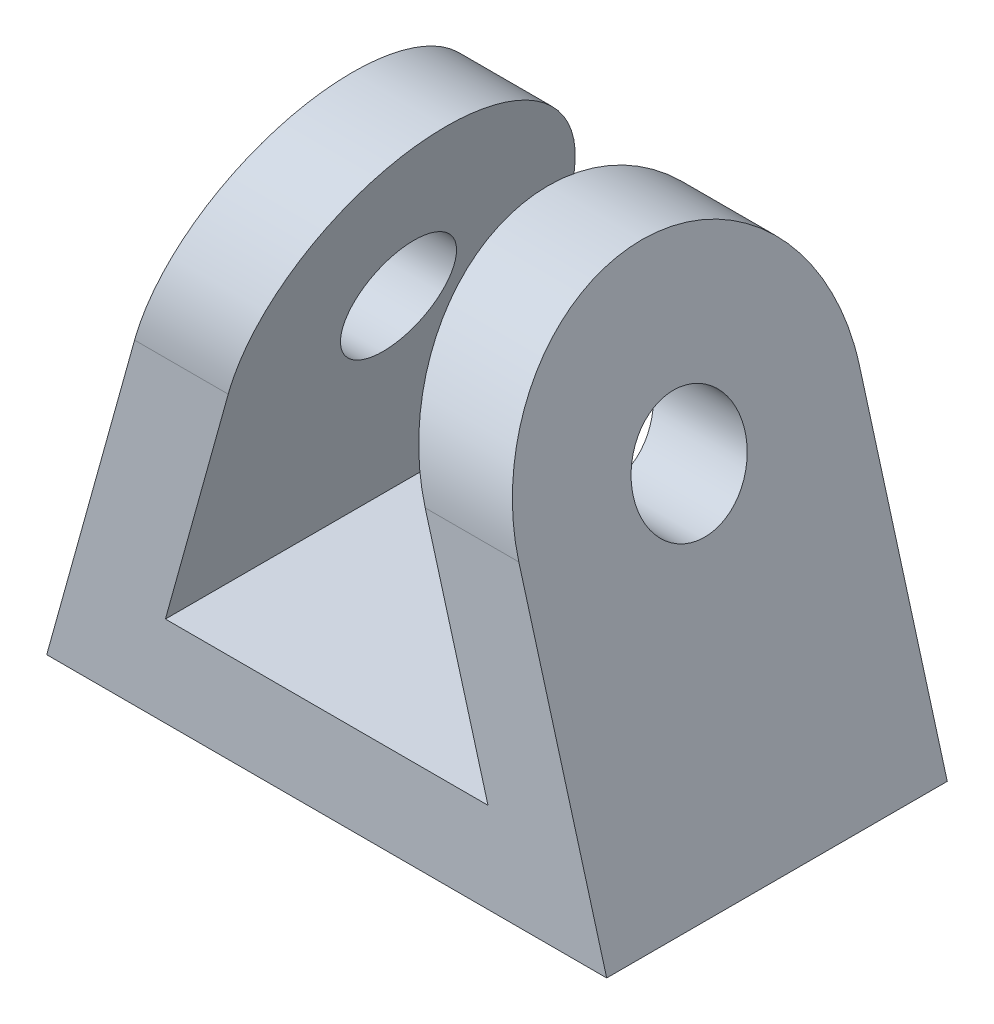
from build123d import *

# Parameters (mm, degrees)
EXTRUDE1_DEPTH = 45.974
SKETCH3_R      = 7.875092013
EXTRUDE2_DEPTH = 56.642


with BuildPart() as part:
    # Sketch1 → Extrude1 (new, symmetric)
    with BuildSketch(Plane.XY):
        Polygon((-39.410519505, 0), (-15.509946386, 86.06748937), (15.509946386, 86.06748937), (39.410519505, 0), align=None)
        Polygon((-22.703197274, 12.7), (-5.856095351, 73.36748937), (5.856095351, 73.36748937), (22.703197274, 12.7), align=None, mode=Mode.SUBTRACT)
    extrude(amount=EXTRUDE1_DEPTH, both=True)


with BuildPart() as body_2:
    # Sketch3 → Extrude2 (new, symmetric)
    with BuildSketch(Plane(origin=(0, 0, 0), x_dir=(0, 0, -1), z_dir=(1, 0, 0))):
        with BuildLine():
            Line((-23.971151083, 0), (-23.971151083, 44.534559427))
            ThreePointArc((-23.971151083, 44.534559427), (0, 68.50571051), (23.971151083, 44.534559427))
            Line((23.971151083, 44.534559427), (23.971151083, 0))
            Line((23.971151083, 0), (-23.971151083, 0))
        make_face()
        with Locations((0, 44.534559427)):
            Circle(SKETCH3_R, mode=Mode.SUBTRACT)
    extrude(amount=EXTRUDE2_DEPTH, both=True)


with BuildPart() as part_1:
    add(part.part)

    # Combine1: intersect body 2
    add(body_2.part, mode=Mode.INTERSECT)


solid = part_1.part
